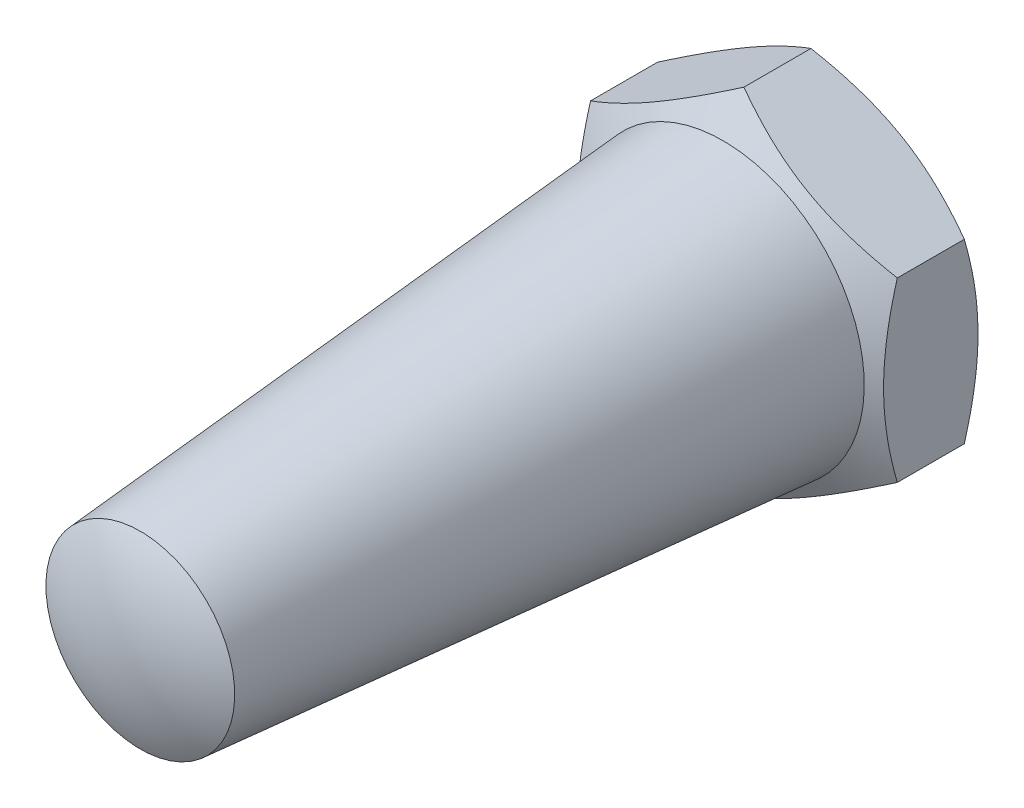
ISO-10303-21;
HEADER;
FILE_DESCRIPTION(('STEP AP214'),'2;1');
FILE_NAME('part.step','',(''),(''),'','','');
FILE_SCHEMA(('AUTOMOTIVE_DESIGN { 1 0 10303 214 1 1 1 1 }'));
ENDSEC;
DATA;
#1=APPLICATION_CONTEXT('core data for automotive mechanical design processes');
#2=APPLICATION_PROTOCOL_DEFINITION('international standard','automotive_design',2000,#1);
#3=PRODUCT_CONTEXT('',#1,'mechanical');
#4=PRODUCT('Part','Part','',(#3));
#5=PRODUCT_RELATED_PRODUCT_CATEGORY('part','',(#4));
#6=PRODUCT_DEFINITION_FORMATION('','',#4);
#7=PRODUCT_DEFINITION_CONTEXT('part definition',#1,'design');
#8=PRODUCT_DEFINITION('design','',#6,#7);
#9=PRODUCT_DEFINITION_SHAPE('','',#8);
#10=(LENGTH_UNIT() NAMED_UNIT(*) SI_UNIT(.MILLI.,.METRE.));
#11=(NAMED_UNIT(*) PLANE_ANGLE_UNIT() SI_UNIT($,.RADIAN.));
#12=(NAMED_UNIT(*) SI_UNIT($,.STERADIAN.) SOLID_ANGLE_UNIT());
#13=UNCERTAINTY_MEASURE_WITH_UNIT(LENGTH_MEASURE(1.E-05),#10,'distance_accuracy_value','');
#14=(GEOMETRIC_REPRESENTATION_CONTEXT(3) GLOBAL_UNCERTAINTY_ASSIGNED_CONTEXT((#13)) GLOBAL_UNIT_ASSIGNED_CONTEXT((#10,
#11,#12)) REPRESENTATION_CONTEXT('',''));
#15=CARTESIAN_POINT('',(0.,0.,0.));
#16=DIRECTION('',(0.,0.,1.));
#17=DIRECTION('',(1.,0.,0.));
#18=AXIS2_PLACEMENT_3D('',#15,#16,#17);
#19=CARTESIAN_POINT('',(0.,0.,0.));
#20=DIRECTION('',(0.,0.,1.));
#21=DIRECTION('',(-0.866025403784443,0.499999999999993,0.));
#22=AXIS2_PLACEMENT_3D('',#19,#20,#21);
#23=CONICAL_SURFACE('',#22,6.5,1.0471975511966);
#24=CARTESIAN_POINT('',(-6.5,-3.75300768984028,0.580623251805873));
#25=CARTESIAN_POINT('',(-6.5,-3.58802701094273,0.533004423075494));
#26=CARTESIAN_POINT('',(-6.5,-3.42243120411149,0.487546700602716));
#27=CARTESIAN_POINT('',(-6.5,-3.08989477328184,0.401548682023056));
#28=CARTESIAN_POINT('',(-6.5,-2.92295360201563,0.361010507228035));
#29=CARTESIAN_POINT('',(-6.5,-2.41945714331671,0.247571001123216));
#30=CARTESIAN_POINT('',(-6.5,-2.08091438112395,0.183047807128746));
#31=CARTESIAN_POINT('',(-6.5,-1.57429129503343,0.107386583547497));
#32=CARTESIAN_POINT('',(-6.5,-1.40772471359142,0.0858328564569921));
#33=CARTESIAN_POINT('',(-6.5,-1.0738389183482,0.0496903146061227));
#34=CARTESIAN_POINT('',(-6.5,-0.90651977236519,0.03510088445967));
#35=CARTESIAN_POINT('',(-6.5,-0.571590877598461,0.013258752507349));
#36=CARTESIAN_POINT('',(-6.5,-0.403981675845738,0.0059977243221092));
#37=CARTESIAN_POINT('',(-6.5,-0.0686176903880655,-0.00103969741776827));
#38=CARTESIAN_POINT('',(-6.5,0.0991370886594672,-0.00081632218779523));
#39=CARTESIAN_POINT('',(-6.5,0.558731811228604,0.0100834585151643));
#40=CARTESIAN_POINT('',(-6.5,0.850421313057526,0.0283818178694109));
#41=CARTESIAN_POINT('',(-6.5,1.43186293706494,0.0864063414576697));
#42=CARTESIAN_POINT('',(-6.5,1.72161301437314,0.126152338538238));
#43=CARTESIAN_POINT('',(-6.5,2.30422480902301,0.22550590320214));
#44=CARTESIAN_POINT('',(-6.5,2.59701301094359,0.285534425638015));
#45=CARTESIAN_POINT('',(-6.5,3.17822309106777,0.421774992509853));
#46=CARTESIAN_POINT('',(-6.5,3.46665241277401,0.497955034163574));
#47=CARTESIAN_POINT('',(-6.5,3.75300768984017,0.580623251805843));
#48=B_SPLINE_CURVE_WITH_KNOTS('',3,(#24,#25,#26,#27,#28,#29,#30,#31,#32,#33,#34,#35,#36,#37,#38,
#39,#40,#41,#42,#43,#44,#45,#46,#47),.UNSPECIFIED.,.F.,.F.,(4,2,2,2,2,2,2,2,2,2,2,4),(0.,
0.515105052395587,1.03043143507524,2.06322554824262,2.56697389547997,3.07067772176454,
3.57380860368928,4.0769239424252,4.9527935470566,5.82947446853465,6.72559912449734,
7.61996451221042),.UNSPECIFIED.);
#49=CARTESIAN_POINT('',(-6.5,0.,0.));
#50=VERTEX_POINT('',#49);
#51=CARTESIAN_POINT('',(-6.5,3.7527767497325,0.580556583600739));
#52=VERTEX_POINT('',#51);
#53=EDGE_CURVE('E144',#50,#52,#48,.T.);
#54=ORIENTED_EDGE('',*,*,#53,.T.);
#55=CARTESIAN_POINT('',(-6.5002,3.75266127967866,0.580623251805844));
#56=CARTESIAN_POINT('',(-6.35732254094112,3.83515161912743,0.533004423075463));
#57=CARTESIAN_POINT('',(-6.21391236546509,3.91794952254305,0.487546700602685));
#58=CARTESIAN_POINT('',(-5.92592736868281,4.08421773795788,0.401548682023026));
#59=CARTESIAN_POINT('',(-5.78135207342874,4.16768832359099,0.361010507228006));
#60=CARTESIAN_POINT('',(-5.34531134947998,4.41943655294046,0.247571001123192));
#61=CARTESIAN_POINT('',(-5.05212471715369,4.58870793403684,0.183047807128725));
#62=CARTESIAN_POINT('',(-4.61337625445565,4.8420194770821,0.107386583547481));
#63=CARTESIAN_POINT('',(-4.46912536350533,4.92530276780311,0.0858328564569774));
#64=CARTESIAN_POINT('',(-4.17997178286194,5.09224566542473,0.0496903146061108));
#65=CARTESIAN_POINT('',(-4.03506915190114,5.17590523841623,0.0351008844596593));
#66=CARTESIAN_POINT('',(-3.74501222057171,5.3433696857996,0.0132587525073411));
#67=CARTESIAN_POINT('',(-3.59985839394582,5.42717428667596,0.00599772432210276));
#68=CARTESIAN_POINT('',(-3.30942466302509,5.59485627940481,-0.00103969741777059));
#69=CARTESIAN_POINT('',(-3.16414476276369,5.67873366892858,-0.000816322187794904));
#70=CARTESIAN_POINT('',(-2.76612405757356,5.90853103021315,0.0100834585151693));
#71=CARTESIAN_POINT('',(-2.51351353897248,6.05437578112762,0.0283818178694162));
#72=CARTESIAN_POINT('',(-2.00997032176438,6.34509659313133,0.0864063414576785));
#73=CARTESIAN_POINT('',(-1.75903939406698,6.48997163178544,0.12615233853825));
#74=CARTESIAN_POINT('',(-1.25448277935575,6.78127752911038,0.225505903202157));
#75=CARTESIAN_POINT('',(-1.00092075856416,6.92767163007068,0.285534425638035));
#76=CARTESIAN_POINT('',(-0.497578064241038,7.21827667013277,0.421774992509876));
#77=CARTESIAN_POINT('',(-0.247790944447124,7.3624913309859,0.4979550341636));
#78=CARTESIAN_POINT('',(0.00019999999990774,7.50566896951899,0.580623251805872));
#79=B_SPLINE_CURVE_WITH_KNOTS('',3,(#55,#56,#57,#58,#59,#60,#61,#62,#63,#64,#65,#66,#67,#68,#69,
#70,#71,#72,#73,#74,#75,#76,#77,#78),.UNSPECIFIED.,.F.,.F.,(4,2,2,2,2,2,2,2,2,2,2,4),(0.,
0.515105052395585,1.03043143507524,2.06322554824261,2.56697389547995,3.07067772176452,
3.57380860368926,4.07692394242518,4.95279354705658,5.82947446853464,6.72559912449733,
7.61996451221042),.UNSPECIFIED.);
#80=CARTESIAN_POINT('',(-3.25000000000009,5.6291651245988,0.));
#81=VERTEX_POINT('',#80);
#82=EDGE_CURVE('E96',#52,#81,#79,.T.);
#83=ORIENTED_EDGE('',*,*,#82,.T.);
#84=CARTESIAN_POINT('',(0.,0.,0.));
#85=DIRECTION('',(0.,0.,-1.));
#86=DIRECTION('',(0.866025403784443,-0.499999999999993,0.));
#87=AXIS2_PLACEMENT_3D('',#84,#85,#86);
#88=CIRCLE('',#87,6.5);
#89=EDGE_CURVE('E271',#50,#81,#88,.T.);
#90=ORIENTED_EDGE('',*,*,#89,.F.);
#91=EDGE_LOOP('',(#54,#83,#90));
#92=FACE_BOUND('',#91,.T.);
#93=ADVANCED_FACE('F14',(#92),#23,.T.);
#94=CARTESIAN_POINT('',(3.24999999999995,5.62916512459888,0.));
#95=VERTEX_POINT('',#94);
#96=EDGE_CURVE('E272',#81,#95,#88,.T.);
#97=ORIENTED_EDGE('',*,*,#96,.F.);
#98=CARTESIAN_POINT('',(0.,7.50555349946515,0.580556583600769));
#99=VERTEX_POINT('',#98);
#100=EDGE_CURVE('E110',#81,#99,#79,.T.);
#101=ORIENTED_EDGE('',*,*,#100,.T.);
#102=CARTESIAN_POINT('',(-5.54115218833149,10.7047392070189,3.20652898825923));
#103=CARTESIAN_POINT('',(-5.29477516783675,10.5624933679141,3.06824212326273));
#104=CARTESIAN_POINT('',(-5.04783912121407,10.4199247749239,2.93126086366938));
#105=CARTESIAN_POINT('',(-4.55255194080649,10.1339705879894,2.66064242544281));
#106=CARTESIAN_POINT('',(-4.30420059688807,9.99058487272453,2.5270057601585));
#107=CARTESIAN_POINT('',(-3.80453528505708,9.70210297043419,2.26315208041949));
#108=CARTESIAN_POINT('',(-3.55321258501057,9.55700174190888,2.13295703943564));
#109=CARTESIAN_POINT('',(-3.04858964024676,9.26565754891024,1.8778010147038));
#110=CARTESIAN_POINT('',(-2.79528948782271,9.11941463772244,1.75283978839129));
#111=CARTESIAN_POINT('',(-2.27788742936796,8.82069241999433,1.50550497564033));
#112=CARTESIAN_POINT('',(-2.01370538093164,8.66816684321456,1.38335372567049));
#113=CARTESIAN_POINT('',(-1.48227292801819,8.36134417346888,1.14812603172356));
#114=CARTESIAN_POINT('',(-1.21502218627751,8.20704688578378,1.03505059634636));
#115=CARTESIAN_POINT('',(-0.677508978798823,7.89671349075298,0.820891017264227));
#116=CARTESIAN_POINT('',(-0.407253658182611,7.74068150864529,0.71978319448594));
#117=CARTESIAN_POINT('',(0.137136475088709,7.42637771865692,0.532757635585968));
#118=CARTESIAN_POINT('',(0.41127005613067,7.26810662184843,0.446835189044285));
#119=CARTESIAN_POINT('',(0.962017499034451,6.95013243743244,0.294716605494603));
#120=CARTESIAN_POINT('',(1.23860819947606,6.79044272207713,0.228410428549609));
#121=CARTESIAN_POINT('',(1.79533222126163,6.46901795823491,0.119232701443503));
#122=CARTESIAN_POINT('',(2.075465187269,6.30728311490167,0.0763588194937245));
#123=CARTESIAN_POINT('',(2.49534082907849,6.0648678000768,0.0324660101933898));
#124=CARTESIAN_POINT('',(2.63431772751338,5.98462945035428,0.0212465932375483));
#125=CARTESIAN_POINT('',(2.91256414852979,5.82398380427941,0.00560203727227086));
#126=CARTESIAN_POINT('',(3.05183366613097,5.74357651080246,0.0011767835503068));
#127=CARTESIAN_POINT('',(3.33040824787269,5.58274140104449,-0.000766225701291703));
#128=CARTESIAN_POINT('',(3.46971331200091,5.50231358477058,0.00171601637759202));
#129=CARTESIAN_POINT('',(3.74810781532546,5.34158244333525,0.0135243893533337));
#130=CARTESIAN_POINT('',(3.8871972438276,5.26127912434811,0.0228508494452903));
#131=CARTESIAN_POINT('',(4.21963736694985,5.06934472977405,0.0531229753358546));
#132=CARTESIAN_POINT('',(4.41277894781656,4.95783438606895,0.0771985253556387));
#133=CARTESIAN_POINT('',(4.79765951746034,4.73562348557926,0.137250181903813));
#134=CARTESIAN_POINT('',(4.98939831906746,4.62492303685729,0.17322784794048));
#135=CARTESIAN_POINT('',(5.56227463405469,4.29417274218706,0.297109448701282));
#136=CARTESIAN_POINT('',(5.94086491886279,4.07559353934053,0.40094059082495));
#137=CARTESIAN_POINT('',(6.50702481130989,3.74872097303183,0.581447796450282));
#138=CARTESIAN_POINT('',(6.6975208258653,3.63873804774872,0.646593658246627));
#139=CARTESIAN_POINT('',(7.07666370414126,3.41983980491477,0.783766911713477));
#140=CARTESIAN_POINT('',(7.26531055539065,3.31092449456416,0.855794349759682));
#141=CARTESIAN_POINT('',(7.64081231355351,3.09412845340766,1.00556559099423));
#142=CARTESIAN_POINT('',(7.82766776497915,2.98624740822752,1.08330759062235));
#143=CARTESIAN_POINT('',(8.19982403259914,2.77138288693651,1.24358180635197));
#144=CARTESIAN_POINT('',(8.38512486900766,2.66439939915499,1.32611396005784));
#145=CARTESIAN_POINT('',(8.82994392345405,2.4075829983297,1.52979204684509));
#146=CARTESIAN_POINT('',(9.08878329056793,2.25814202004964,1.65291133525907));
#147=CARTESIAN_POINT('',(9.60418751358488,1.96057325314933,1.90536084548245));
#148=CARTESIAN_POINT('',(9.86075221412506,1.81244555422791,2.03469148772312));
#149=CARTESIAN_POINT('',(10.3720363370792,1.51725552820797,2.29828873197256));
#150=CARTESIAN_POINT('',(10.6267553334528,1.37019344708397,2.43255643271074));
#151=CARTESIAN_POINT('',(11.1346169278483,1.07697941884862,2.70501702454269));
#152=CARTESIAN_POINT('',(11.387759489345,0.930827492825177,2.8432100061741));
#153=CARTESIAN_POINT('',(11.8930170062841,0.639116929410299,3.12292631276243));
#154=CARTESIAN_POINT('',(12.1451304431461,0.493559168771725,3.26445328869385));
#155=CARTESIAN_POINT('',(12.6482508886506,0.203082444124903,3.55010805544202));
#156=CARTESIAN_POINT('',(12.8992578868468,0.0581634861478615,3.69423587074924));
#157=CARTESIAN_POINT('',(13.6508155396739,-0.375748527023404,4.1297725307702));
#158=CARTESIAN_POINT('',(14.1499773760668,-0.663939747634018,4.42437620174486));
#159=CARTESIAN_POINT('',(15.1023905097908,-1.21381572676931,4.99368726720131));
#160=CARTESIAN_POINT('',(15.5558642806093,-1.4756289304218,5.26790069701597));
#161=CARTESIAN_POINT('',(16.4611277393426,-1.99828303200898,5.82005580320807));
#162=CARTESIAN_POINT('',(16.9129173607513,-2.25912389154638,6.09799762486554));
#163=CARTESIAN_POINT('',(17.813986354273,-2.77935631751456,6.65596618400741));
#164=CARTESIAN_POINT('',(18.2632692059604,-3.03874989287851,6.93598544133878));
#165=CARTESIAN_POINT('',(19.1607624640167,-3.55691786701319,7.49823452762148));
#166=CARTESIAN_POINT('',(19.6089729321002,-3.81569230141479,7.78046422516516));
#167=CARTESIAN_POINT('',(20.0567911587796,-4.0742402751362,8.06351575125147));
#168=B_SPLINE_CURVE_WITH_KNOTS('',3,(#102,#103,#104,#105,#106,#107,#108,#109,#110,#111,#112,
#113,#114,#115,#116,#117,#118,#119,#120,#121,#122,#123,#124,#125,#126,#127,#128,#129,#130,#131,
#132,#133,#134,#135,#136,#137,#138,#139,#140,#141,#142,#143,#144,#145,#146,#147,#148,#149,#150,
#151,#152,#153,#154,#155,#156,#157,#158,#159,#160,#161,#162,#163,#164,#165,#166,#167),
.UNSPECIFIED.,.F.,.F.,(4,2,2,2,2,2,2,2,2,2,2,2,2,2,2,2,2,2,2,2,2,2,2,2,2,2,2,2,2,2,2,2,4),(0.,
0.948973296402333,1.89809136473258,2.85225848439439,3.80638133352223,4.79206603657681,
5.77786012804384,6.76166991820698,7.74517399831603,8.72305155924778,9.70083179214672,
10.1833150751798,10.6657902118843,11.1482651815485,11.630763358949,12.3033341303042,
12.9759930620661,14.3220280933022,15.0101990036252,15.6983745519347,16.3863338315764,
17.0742841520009,18.0439299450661,19.0136414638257,19.9835701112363,20.9535211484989,
21.9245888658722,22.8956657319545,24.8375327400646,26.6107620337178,28.3840606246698,
30.1526583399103,31.9211517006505),.UNSPECIFIED.);
#169=EDGE_CURVE('E182',#99,#95,#168,.T.);
#170=ORIENTED_EDGE('',*,*,#169,.T.);
#171=EDGE_LOOP('',(#97,#101,#170));
#172=FACE_BOUND('',#171,.T.);
#173=ADVANCED_FACE('F139',(#172),#23,.T.);
#174=CARTESIAN_POINT('',(6.5,0.,0.));
#175=VERTEX_POINT('',#174);
#176=EDGE_CURVE('E107',#95,#175,#88,.T.);
#177=ORIENTED_EDGE('',*,*,#176,.F.);
#178=CARTESIAN_POINT('',(6.5,3.7527767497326,0.580556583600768));
#179=VERTEX_POINT('',#178);
#180=EDGE_CURVE('E175',#95,#179,#168,.T.);
#181=ORIENTED_EDGE('',*,*,#180,.T.);
#182=CARTESIAN_POINT('',(6.5,3.75300768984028,0.580623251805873));
#183=CARTESIAN_POINT('',(6.5,3.58802701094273,0.533004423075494));
#184=CARTESIAN_POINT('',(6.5,3.42243120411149,0.487546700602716));
#185=CARTESIAN_POINT('',(6.5,3.08989477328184,0.401548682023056));
#186=CARTESIAN_POINT('',(6.5,2.92295360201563,0.361010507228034));
#187=CARTESIAN_POINT('',(6.5,2.41945714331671,0.247571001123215));
#188=CARTESIAN_POINT('',(6.5,2.08091438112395,0.183047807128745));
#189=CARTESIAN_POINT('',(6.5,1.57429129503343,0.107386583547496));
#190=CARTESIAN_POINT('',(6.5,1.40772471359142,0.0858328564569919));
#191=CARTESIAN_POINT('',(6.5,1.0738389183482,0.0496903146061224));
#192=CARTESIAN_POINT('',(6.5,0.90651977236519,0.0351008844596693));
#193=CARTESIAN_POINT('',(6.5,0.571590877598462,0.0132587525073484));
#194=CARTESIAN_POINT('',(6.5,0.403981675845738,0.00599772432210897));
#195=CARTESIAN_POINT('',(6.5,0.0686176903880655,-0.00103969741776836));
#196=CARTESIAN_POINT('',(6.5,-0.0991370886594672,-0.000816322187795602));
#197=CARTESIAN_POINT('',(6.5,-0.558731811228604,0.0100834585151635));
#198=CARTESIAN_POINT('',(6.5,-0.850421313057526,0.0283818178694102));
#199=CARTESIAN_POINT('',(6.5,-1.43186293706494,0.0864063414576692));
#200=CARTESIAN_POINT('',(6.5,-1.72161301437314,0.126152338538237));
#201=CARTESIAN_POINT('',(6.5,-2.30422480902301,0.225505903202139));
#202=CARTESIAN_POINT('',(6.5,-2.59701301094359,0.285534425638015));
#203=CARTESIAN_POINT('',(6.5,-3.17822309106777,0.421774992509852));
#204=CARTESIAN_POINT('',(6.5,-3.46665241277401,0.497955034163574));
#205=CARTESIAN_POINT('',(6.5,-3.75300768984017,0.580623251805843));
#206=B_SPLINE_CURVE_WITH_KNOTS('',3,(#182,#183,#184,#185,#186,#187,#188,#189,#190,#191,#192,
#193,#194,#195,#196,#197,#198,#199,#200,#201,#202,#203,#204,#205),.UNSPECIFIED.,.F.,.F.,(4,2,2,
2,2,2,2,2,2,2,2,4),(0.,0.515105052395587,1.03043143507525,2.06322554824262,2.56697389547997,
3.07067772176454,3.57380860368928,4.0769239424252,4.9527935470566,5.82947446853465,
6.72559912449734,7.61996451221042),.UNSPECIFIED.);
#207=EDGE_CURVE('E219',#179,#175,#206,.T.);
#208=ORIENTED_EDGE('',*,*,#207,.T.);
#209=EDGE_LOOP('',(#177,#181,#208));
#210=FACE_BOUND('',#209,.T.);
#211=ADVANCED_FACE('F278',(#210),#23,.T.);
#212=CARTESIAN_POINT('',(3.2500000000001,-5.6291651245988,0.));
#213=VERTEX_POINT('',#212);
#214=EDGE_CURVE('E104',#175,#213,#88,.T.);
#215=ORIENTED_EDGE('',*,*,#214,.F.);
#216=CARTESIAN_POINT('',(6.5,-3.7527767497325,0.580556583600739));
#217=VERTEX_POINT('',#216);
#218=EDGE_CURVE('E167',#175,#217,#206,.T.);
#219=ORIENTED_EDGE('',*,*,#218,.T.);
#220=CARTESIAN_POINT('',(6.5002,-3.75266127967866,0.580623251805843));
#221=CARTESIAN_POINT('',(6.35732254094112,-3.83515161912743,0.533004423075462));
#222=CARTESIAN_POINT('',(6.21391236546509,-3.91794952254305,0.487546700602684));
#223=CARTESIAN_POINT('',(5.92592736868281,-4.08421773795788,0.401548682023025));
#224=CARTESIAN_POINT('',(5.78135207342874,-4.16768832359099,0.361010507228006));
#225=CARTESIAN_POINT('',(5.34531134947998,-4.41943655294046,0.247571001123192));
#226=CARTESIAN_POINT('',(5.0521247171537,-4.58870793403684,0.183047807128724));
#227=CARTESIAN_POINT('',(4.61337625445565,-4.8420194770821,0.10738658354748));
#228=CARTESIAN_POINT('',(4.46912536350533,-4.92530276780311,0.0858328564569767));
#229=CARTESIAN_POINT('',(4.17997178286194,-5.09224566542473,0.0496903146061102));
#230=CARTESIAN_POINT('',(4.03506915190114,-5.17590523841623,0.0351008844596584));
#231=CARTESIAN_POINT('',(3.74501222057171,-5.3433696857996,0.0132587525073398));
#232=CARTESIAN_POINT('',(3.59985839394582,-5.42717428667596,0.00599772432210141));
#233=CARTESIAN_POINT('',(3.30942466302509,-5.59485627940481,-0.00103969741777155));
#234=CARTESIAN_POINT('',(3.16414476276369,-5.67873366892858,-0.000816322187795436));
#235=CARTESIAN_POINT('',(2.76612405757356,-5.90853103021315,0.0100834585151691));
#236=CARTESIAN_POINT('',(2.51351353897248,-6.05437578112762,0.0283818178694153));
#237=CARTESIAN_POINT('',(2.00997032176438,-6.34509659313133,0.0864063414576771));
#238=CARTESIAN_POINT('',(1.75903939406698,-6.48997163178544,0.126152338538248));
#239=CARTESIAN_POINT('',(1.25448277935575,-6.78127752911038,0.225505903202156));
#240=CARTESIAN_POINT('',(1.00092075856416,-6.92767163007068,0.285534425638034));
#241=CARTESIAN_POINT('',(0.497578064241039,-7.21827667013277,0.421774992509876));
#242=CARTESIAN_POINT('',(0.247790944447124,-7.3624913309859,0.497955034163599));
#243=CARTESIAN_POINT('',(-0.00019999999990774,-7.50566896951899,0.580623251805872));
#244=B_SPLINE_CURVE_WITH_KNOTS('',3,(#220,#221,#222,#223,#224,#225,#226,#227,#228,#229,#230,
#231,#232,#233,#234,#235,#236,#237,#238,#239,#240,#241,#242,#243),.UNSPECIFIED.,.F.,.F.,(4,2,2,
2,2,2,2,2,2,2,2,4),(0.,0.515105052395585,1.03043143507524,2.06322554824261,2.56697389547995,
3.07067772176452,3.57380860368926,4.07692394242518,4.95279354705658,5.82947446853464,
6.72559912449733,7.61996451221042),.UNSPECIFIED.);
#245=EDGE_CURVE('E217',#217,#213,#244,.T.);
#246=ORIENTED_EDGE('',*,*,#245,.T.);
#247=EDGE_LOOP('',(#215,#219,#246));
#248=FACE_BOUND('',#247,.T.);
#249=ADVANCED_FACE('F280',(#248),#23,.T.);
#250=CARTESIAN_POINT('',(-3.24999999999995,-5.62916512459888,0.));
#251=VERTEX_POINT('',#250);
#252=EDGE_CURVE('E109',#213,#251,#88,.T.);
#253=ORIENTED_EDGE('',*,*,#252,.F.);
#254=CARTESIAN_POINT('',(0.,-7.50555349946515,0.580556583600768));
#255=VERTEX_POINT('',#254);
#256=EDGE_CURVE('E159',#213,#255,#244,.T.);
#257=ORIENTED_EDGE('',*,*,#256,.T.);
#258=CARTESIAN_POINT('',(-12.0411521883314,-0.553591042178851,3.20652898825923));
#259=CARTESIAN_POINT('',(-11.7947751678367,-0.695836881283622,3.06824212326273));
#260=CARTESIAN_POINT('',(-11.547839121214,-0.838405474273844,2.93126086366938));
#261=CARTESIAN_POINT('',(-11.0525519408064,-1.12435966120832,2.66064242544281));
#262=CARTESIAN_POINT('',(-10.804200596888,-1.26774537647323,2.5270057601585));
#263=CARTESIAN_POINT('',(-10.304535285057,-1.55622727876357,2.26315208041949));
#264=CARTESIAN_POINT('',(-10.0532125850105,-1.70132850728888,2.13295703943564));
#265=CARTESIAN_POINT('',(-9.54858964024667,-1.99267270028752,1.8778010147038));
#266=CARTESIAN_POINT('',(-9.29528948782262,-2.13891561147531,1.75283978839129));
#267=CARTESIAN_POINT('',(-8.77788742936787,-2.43763782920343,1.50550497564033));
#268=CARTESIAN_POINT('',(-8.51370538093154,-2.5901634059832,1.38335372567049));
#269=CARTESIAN_POINT('',(-7.9822729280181,-2.89698607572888,1.14812603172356));
#270=CARTESIAN_POINT('',(-7.71502218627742,-3.05128336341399,1.03505059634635));
#271=CARTESIAN_POINT('',(-7.17750897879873,-3.36161675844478,0.820891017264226));
#272=CARTESIAN_POINT('',(-6.90725365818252,-3.51764874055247,0.719783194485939));
#273=CARTESIAN_POINT('',(-6.3628635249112,-3.83195253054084,0.532757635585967));
#274=CARTESIAN_POINT('',(-6.08872994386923,-3.99022362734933,0.446835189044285));
#275=CARTESIAN_POINT('',(-5.53798250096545,-4.30819781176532,0.294716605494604));
#276=CARTESIAN_POINT('',(-5.26139180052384,-4.46788752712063,0.228410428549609));
#277=CARTESIAN_POINT('',(-4.70466777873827,-4.78931229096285,0.119232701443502));
#278=CARTESIAN_POINT('',(-4.42453481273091,-4.95104713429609,0.0763588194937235));
#279=CARTESIAN_POINT('',(-4.00465917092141,-5.19346244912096,0.0324660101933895));
#280=CARTESIAN_POINT('',(-3.86568227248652,-5.27370079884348,0.0212465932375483));
#281=CARTESIAN_POINT('',(-3.58743585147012,-5.43434644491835,0.00560203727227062));
#282=CARTESIAN_POINT('',(-3.44816633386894,-5.5147537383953,0.00117678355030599));
#283=CARTESIAN_POINT('',(-3.16959175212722,-5.67558884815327,-0.000766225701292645));
#284=CARTESIAN_POINT('',(-3.030286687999,-5.75601666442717,0.00171601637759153));
#285=CARTESIAN_POINT('',(-2.75189218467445,-5.91674780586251,0.0135243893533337));
#286=CARTESIAN_POINT('',(-2.61280275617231,-5.99705112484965,0.0228508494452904));
#287=CARTESIAN_POINT('',(-2.28036263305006,-6.18898551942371,0.0531229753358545));
#288=CARTESIAN_POINT('',(-2.08722105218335,-6.30049586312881,0.0771985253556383));
#289=CARTESIAN_POINT('',(-1.70234048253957,-6.5227067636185,0.137250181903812));
#290=CARTESIAN_POINT('',(-1.51060168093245,-6.63340721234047,0.17322784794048));
#291=CARTESIAN_POINT('',(-0.937725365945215,-6.9641575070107,0.297109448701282));
#292=CARTESIAN_POINT('',(-0.559135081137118,-7.18273670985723,0.400940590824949));
#293=CARTESIAN_POINT('',(0.0070248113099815,-7.50960927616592,0.581447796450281));
#294=CARTESIAN_POINT('',(0.197520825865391,-7.61959220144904,0.646593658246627));
#295=CARTESIAN_POINT('',(0.576663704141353,-7.83849044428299,0.783766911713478));
#296=CARTESIAN_POINT('',(0.765310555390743,-7.9474057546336,0.855794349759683));
#297=CARTESIAN_POINT('',(1.14081231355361,-8.1642017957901,1.00556559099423));
#298=CARTESIAN_POINT('',(1.32766776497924,-8.27208284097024,1.08330759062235));
#299=CARTESIAN_POINT('',(1.69982403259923,-8.48694736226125,1.24358180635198));
#300=CARTESIAN_POINT('',(1.88512486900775,-8.59393085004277,1.32611396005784));
#301=CARTESIAN_POINT('',(2.32994392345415,-8.85074725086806,1.52979204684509));
#302=CARTESIAN_POINT('',(2.58878329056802,-9.00018822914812,1.65291133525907));
#303=CARTESIAN_POINT('',(3.10418751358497,-9.29775699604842,1.90536084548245));
#304=CARTESIAN_POINT('',(3.36075221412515,-9.44588469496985,2.03469148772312));
#305=CARTESIAN_POINT('',(3.87203633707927,-9.74107472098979,2.29828873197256));
#306=CARTESIAN_POINT('',(4.12675533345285,-9.88813680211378,2.43255643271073));
#307=CARTESIAN_POINT('',(4.63461692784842,-10.1813508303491,2.70501702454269));
#308=CARTESIAN_POINT('',(4.88775948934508,-10.3275027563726,2.84321000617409));
#309=CARTESIAN_POINT('',(5.3930170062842,-10.6192133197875,3.12292631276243));
#310=CARTESIAN_POINT('',(5.64513044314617,-10.764771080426,3.26445328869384));
#311=CARTESIAN_POINT('',(6.14825088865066,-11.0552478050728,3.55010805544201));
#312=CARTESIAN_POINT('',(6.39925788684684,-11.2001667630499,3.69423587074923));
#313=CARTESIAN_POINT('',(7.15081553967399,-11.6340787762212,4.1297725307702));
#314=CARTESIAN_POINT('',(7.64997737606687,-11.9222699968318,4.42437620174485));
#315=CARTESIAN_POINT('',(8.6023905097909,-12.4721459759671,4.99368726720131));
#316=CARTESIAN_POINT('',(9.05586428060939,-12.7339591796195,5.26790069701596));
#317=CARTESIAN_POINT('',(9.96112773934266,-13.2566132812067,5.82005580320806));
#318=CARTESIAN_POINT('',(10.4129173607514,-13.5174541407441,6.09799762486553));
#319=CARTESIAN_POINT('',(11.3139863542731,-14.0376865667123,6.6559661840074));
#320=CARTESIAN_POINT('',(11.7632692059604,-14.2970801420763,6.93598544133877));
#321=CARTESIAN_POINT('',(12.6607624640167,-14.8152481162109,7.49823452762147));
#322=CARTESIAN_POINT('',(13.1089729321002,-15.0740225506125,7.78046422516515));
#323=CARTESIAN_POINT('',(13.5567911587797,-15.3325705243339,8.06351575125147));
#324=B_SPLINE_CURVE_WITH_KNOTS('',3,(#258,#259,#260,#261,#262,#263,#264,#265,#266,#267,#268,
#269,#270,#271,#272,#273,#274,#275,#276,#277,#278,#279,#280,#281,#282,#283,#284,#285,#286,#287,
#288,#289,#290,#291,#292,#293,#294,#295,#296,#297,#298,#299,#300,#301,#302,#303,#304,#305,#306,
#307,#308,#309,#310,#311,#312,#313,#314,#315,#316,#317,#318,#319,#320,#321,#322,#323),
.UNSPECIFIED.,.F.,.F.,(4,2,2,2,2,2,2,2,2,2,2,2,2,2,2,2,2,2,2,2,2,2,2,2,2,2,2,2,2,2,2,2,4),(0.,
0.948973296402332,1.89809136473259,2.85225848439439,3.80638133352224,4.79206603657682,
5.77786012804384,6.76166991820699,7.74517399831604,8.72305155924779,9.70083179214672,
10.1833150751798,10.6657902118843,11.1482651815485,11.630763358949,12.3033341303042,
12.9759930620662,14.3220280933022,15.0101990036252,15.6983745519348,16.3863338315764,
17.0742841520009,18.0439299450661,19.0136414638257,19.9835701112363,20.9535211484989,
21.9245888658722,22.8956657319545,24.8375327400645,26.6107620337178,28.3840606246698,
30.1526583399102,31.9211517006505),.UNSPECIFIED.);
#325=EDGE_CURVE('E228',#255,#251,#324,.F.);
#326=ORIENTED_EDGE('',*,*,#325,.T.);
#327=EDGE_LOOP('',(#253,#257,#326));
#328=FACE_BOUND('',#327,.T.);
#329=ADVANCED_FACE('F293',(#328),#23,.T.);
#330=EDGE_CURVE('E239',#251,#50,#88,.T.);
#331=ORIENTED_EDGE('',*,*,#330,.F.);
#332=CARTESIAN_POINT('',(-6.5,-3.7527767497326,0.580556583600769));
#333=VERTEX_POINT('',#332);
#334=EDGE_CURVE('E87',#251,#333,#324,.F.);
#335=ORIENTED_EDGE('',*,*,#334,.T.);
#336=EDGE_CURVE('E88',#333,#50,#48,.T.);
#337=ORIENTED_EDGE('',*,*,#336,.T.);
#338=EDGE_LOOP('',(#331,#335,#337));
#339=FACE_BOUND('',#338,.T.);
#340=ADVANCED_FACE('F135',(#339),#23,.T.);
#341=CARTESIAN_POINT('',(5.62916512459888,-3.24999999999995,0.));
#342=DIRECTION('',(0.,0.,-1.));
#343=DIRECTION('',(0.866025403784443,-0.499999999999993,0.));
#344=AXIS2_PLACEMENT_3D('',#341,#342,#343);
#345=PLANE('',#344);
#346=CARTESIAN_POINT('',(0.,0.,0.));
#347=DIRECTION('',(0.,0.,-1.));
#348=DIRECTION('',(-0.866025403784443,0.499999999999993,0.));
#349=AXIS2_PLACEMENT_3D('',#346,#347,#348);
#350=CIRCLE('',#349,4.);
#351=CARTESIAN_POINT('',(-3.46410161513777,1.99999999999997,0.));
#352=VERTEX_POINT('',#351);
#353=EDGE_CURVE('E256',#352,#352,#350,.T.);
#354=ORIENTED_EDGE('',*,*,#353,.F.);
#355=EDGE_LOOP('',(#354));
#356=FACE_BOUND('',#355,.T.);
#357=ORIENTED_EDGE('',*,*,#252,.T.);
#358=ORIENTED_EDGE('',*,*,#330,.T.);
#359=ORIENTED_EDGE('',*,*,#89,.T.);
#360=ORIENTED_EDGE('',*,*,#96,.T.);
#361=ORIENTED_EDGE('',*,*,#176,.T.);
#362=ORIENTED_EDGE('',*,*,#214,.T.);
#363=EDGE_LOOP('',(#357,#358,#359,#360,#361,#362));
#364=FACE_BOUND('',#363,.T.);
#365=ADVANCED_FACE('F130',(#356,#364),#345,.T.);
#366=CARTESIAN_POINT('',(0.,7.50555349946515,-30.));
#367=DIRECTION('',(-0.500000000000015,0.866025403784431,0.));
#368=DIRECTION('',(-0.866025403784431,-0.500000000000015,0.));
#369=AXIS2_PLACEMENT_3D('',#366,#367,#368);
#370=PLANE('',#369);
#371=DIRECTION('',(0.,0.,1.));
#372=VECTOR('',#371,1.);
#373=CARTESIAN_POINT('',(0.,7.50555349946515,-30.));
#374=LINE('',#373,#372);
#375=CARTESIAN_POINT('',(0.,7.50555349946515,3.41944341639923));
#376=VERTEX_POINT('',#375);
#377=EDGE_CURVE('E254',#99,#376,#374,.T.);
#378=ORIENTED_EDGE('',*,*,#377,.F.);
#379=ORIENTED_EDGE('',*,*,#100,.F.);
#380=ORIENTED_EDGE('',*,*,#82,.F.);
#381=DIRECTION('',(0.,0.,1.));
#382=VECTOR('',#381,1.);
#383=CARTESIAN_POINT('',(-6.5,3.7527767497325,-30.));
#384=LINE('',#383,#382);
#385=CARTESIAN_POINT('',(-6.5,3.7527767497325,3.41944341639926));
#386=VERTEX_POINT('',#385);
#387=EDGE_CURVE('E35',#52,#386,#384,.T.);
#388=ORIENTED_EDGE('',*,*,#387,.T.);
#389=CARTESIAN_POINT('',(0.00019999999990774,7.50566896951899,3.41937674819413));
#390=CARTESIAN_POINT('',(-0.142677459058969,7.42317863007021,3.46699557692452));
#391=CARTESIAN_POINT('',(-0.286087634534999,7.34038072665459,3.5124532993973));
#392=CARTESIAN_POINT('',(-0.574072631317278,7.17411251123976,3.59845131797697));
#393=CARTESIAN_POINT('',(-0.718647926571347,7.09064192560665,3.63898949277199));
#394=CARTESIAN_POINT('',(-1.15468865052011,6.83889369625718,3.7524289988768));
#395=CARTESIAN_POINT('',(-1.4478752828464,6.6696223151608,3.81695219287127));
#396=CARTESIAN_POINT('',(-1.88662374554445,6.41631077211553,3.89261341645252));
#397=CARTESIAN_POINT('',(-2.03087463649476,6.33302748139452,3.91416714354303));
#398=CARTESIAN_POINT('',(-2.32002821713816,6.16608458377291,3.9503096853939));
#399=CARTESIAN_POINT('',(-2.46493084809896,6.0824250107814,3.96489911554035));
#400=CARTESIAN_POINT('',(-2.75498777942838,5.91496056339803,3.98674124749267));
#401=CARTESIAN_POINT('',(-2.90014160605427,5.83115596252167,3.99400227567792));
#402=CARTESIAN_POINT('',(-3.19057533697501,5.66347396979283,4.00103969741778));
#403=CARTESIAN_POINT('',(-3.33585523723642,5.57959658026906,4.0008163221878));
#404=CARTESIAN_POINT('',(-3.73387594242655,5.34979921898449,3.98991654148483));
#405=CARTESIAN_POINT('',(-3.98648646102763,5.20395446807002,3.9716181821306));
#406=CARTESIAN_POINT('',(-4.49002967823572,4.9132336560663,3.91359365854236));
#407=CARTESIAN_POINT('',(-4.74096060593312,4.7683586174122,3.87384766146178));
#408=CARTESIAN_POINT('',(-5.24551722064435,4.47705272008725,3.77449409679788));
#409=CARTESIAN_POINT('',(-5.49907924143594,4.33065861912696,3.71446557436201));
#410=CARTESIAN_POINT('',(-6.00242193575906,4.04005357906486,3.57822500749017));
#411=CARTESIAN_POINT('',(-6.25220905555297,3.89583891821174,3.50204496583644));
#412=CARTESIAN_POINT('',(-6.5002,3.75266127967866,3.41937674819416));
#413=B_SPLINE_CURVE_WITH_KNOTS('',3,(#389,#390,#391,#392,#393,#394,#395,#396,#397,#398,#399,
#400,#401,#402,#403,#404,#405,#406,#407,#408,#409,#410,#411,#412),.UNSPECIFIED.,.F.,.F.,(4,2,2,
2,2,2,2,2,2,2,2,4),(0.,0.51510505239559,1.03043143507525,2.06322554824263,2.56697389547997,
3.07067772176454,3.57380860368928,4.07692394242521,4.9527935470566,5.82947446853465,
6.72559912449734,7.61996451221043),.UNSPECIFIED.);
#414=EDGE_CURVE('E93',#376,#386,#413,.T.);
#415=ORIENTED_EDGE('',*,*,#414,.F.);
#416=EDGE_LOOP('',(#378,#379,#380,#388,#415));
#417=FACE_BOUND('',#416,.T.);
#418=ADVANCED_FACE('F92',(#417),#370,.T.);
#419=CARTESIAN_POINT('',(6.5,3.7527767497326,-30.));
#420=DIRECTION('',(0.499999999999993,0.866025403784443,0.));
#421=DIRECTION('',(-0.866025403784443,0.499999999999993,0.));
#422=AXIS2_PLACEMENT_3D('',#419,#420,#421);
#423=PLANE('',#422);
#424=DIRECTION('',(0.,0.,1.));
#425=VECTOR('',#424,1.);
#426=CARTESIAN_POINT('',(6.5,3.7527767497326,-30.));
#427=LINE('',#426,#425);
#428=CARTESIAN_POINT('',(6.5,3.7527767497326,3.41944341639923));
#429=VERTEX_POINT('',#428);
#430=EDGE_CURVE('E251',#179,#429,#427,.T.);
#431=ORIENTED_EDGE('',*,*,#430,.F.);
#432=ORIENTED_EDGE('',*,*,#180,.F.);
#433=ORIENTED_EDGE('',*,*,#169,.F.);
#434=ORIENTED_EDGE('',*,*,#377,.T.);
#435=CARTESIAN_POINT('',(-5.50464676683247,10.6836627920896,0.813953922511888));
#436=CARTESIAN_POINT('',(-5.25856626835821,10.5415881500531,0.951906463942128));
#437=CARTESIAN_POINT('',(-5.01192350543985,10.3991888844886,1.08854446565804));
#438=CARTESIAN_POINT('',(-4.517214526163,10.1135685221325,1.35845260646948));
#439=CARTESIAN_POINT('',(-4.26914809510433,9.97034730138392,1.49172222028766));
#440=CARTESIAN_POINT('',(-3.77002670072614,9.68217942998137,1.75481910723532));
#441=CARTESIAN_POINT('',(-3.5189628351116,9.53722763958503,1.88462393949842));
#442=CARTESIAN_POINT('',(-3.01484675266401,9.2461760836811,2.13895929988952));
#443=CARTESIAN_POINT('',(-2.76179462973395,9.10007637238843,2.26349007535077));
#444=CARTESIAN_POINT('',(-2.24505569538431,8.80173700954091,2.50981565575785));
#445=CARTESIAN_POINT('',(-1.98129000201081,8.64945181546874,2.63139101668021));
#446=CARTESIAN_POINT('',(-1.45068168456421,8.34310496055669,2.86540938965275));
#447=CARTESIAN_POINT('',(-1.18383872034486,8.18904310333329,2.97785138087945));
#448=CARTESIAN_POINT('',(-0.647143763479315,7.87918212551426,3.19067263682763));
#449=CARTESIAN_POINT('',(-0.377299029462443,7.72338719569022,3.29107606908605));
#450=CARTESIAN_POINT('',(0.166264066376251,7.40956089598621,3.4766162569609));
#451=CARTESIAN_POINT('',(0.439981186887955,7.25153024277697,3.56175779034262));
#452=CARTESIAN_POINT('',(0.989916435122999,6.93402497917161,3.71225918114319));
#453=CARTESIAN_POINT('',(1.2661121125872,6.77456333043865,3.77772667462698));
#454=CARTESIAN_POINT('',(1.82200305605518,6.45361954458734,3.88518106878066));
#455=CARTESIAN_POINT('',(2.10169797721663,6.29213760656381,3.92717026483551));
#456=CARTESIAN_POINT('',(2.52089047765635,6.05011670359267,3.96975845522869));
#457=CARTESIAN_POINT('',(2.65964585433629,5.970006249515,3.98054959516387));
#458=CARTESIAN_POINT('',(2.9374336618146,5.8096253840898,3.99535095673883));
#459=CARTESIAN_POINT('',(3.07646608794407,5.72935497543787,3.99936129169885));
#460=CARTESIAN_POINT('',(3.35455197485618,5.56880201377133,4.00049782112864));
#461=CARTESIAN_POINT('',(3.4936054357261,5.48851946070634,3.99762398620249));
#462=CARTESIAN_POINT('',(3.77148360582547,5.32808642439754,3.98506477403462));
#463=CARTESIAN_POINT('',(3.91030830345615,5.24793594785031,3.97537906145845));
#464=CARTESIAN_POINT('',(4.24317824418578,5.05575339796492,3.94419318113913));
#465=CARTESIAN_POINT('',(4.43700457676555,4.94384771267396,3.91951007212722));
#466=CARTESIAN_POINT('',(4.8232260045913,4.72086266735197,3.85820420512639));
#467=CARTESIAN_POINT('',(5.01562090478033,4.60978341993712,3.8215798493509));
#468=CARTESIAN_POINT('',(5.59043287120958,4.27791557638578,3.69573612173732));
#469=CARTESIAN_POINT('',(5.97026630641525,4.05861864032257,3.59056847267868));
#470=CARTESIAN_POINT('',(6.53828857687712,3.73067082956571,3.40807580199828));
#471=CARTESIAN_POINT('',(6.72942027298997,3.62032089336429,3.34226066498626));
#472=CARTESIAN_POINT('',(7.10982731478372,3.40069278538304,3.20376518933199));
#473=CARTESIAN_POINT('',(7.29910264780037,3.29141462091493,3.13108480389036));
#474=CARTESIAN_POINT('',(7.67585644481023,3.07389571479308,2.98002751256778));
#475=CARTESIAN_POINT('',(7.86333546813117,2.96565465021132,2.90165244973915));
#476=CARTESIAN_POINT('',(8.23673796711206,2.75007061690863,2.74013098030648));
#477=CARTESIAN_POINT('',(8.42266146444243,2.64272763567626,2.65698464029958));
#478=CARTESIAN_POINT('',(8.87505986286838,2.38153529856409,2.44905554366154));
#479=CARTESIAN_POINT('',(9.14079224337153,2.2281146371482,2.32212222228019));
#480=CARTESIAN_POINT('',(9.6698907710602,1.92263945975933,2.0618223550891));
#481=CARTESIAN_POINT('',(9.93325674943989,1.77058504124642,1.9284553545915));
#482=CARTESIAN_POINT('',(10.4580868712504,1.4675742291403,1.65663156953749));
#483=CARTESIAN_POINT('',(10.7195505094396,1.31661812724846,1.51817348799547));
#484=CARTESIAN_POINT('',(11.2408413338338,1.01565072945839,1.237238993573));
#485=CARTESIAN_POINT('',(11.5006685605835,0.865639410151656,1.09476268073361));
#486=CARTESIAN_POINT('',(12.019282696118,0.566217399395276,0.806400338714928));
#487=CARTESIAN_POINT('',(12.278067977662,0.41680764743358,0.660510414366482));
#488=CARTESIAN_POINT('',(12.7945079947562,0.118640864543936,0.366083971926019));
#489=CARTESIAN_POINT('',(13.0521627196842,-0.0301161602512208,0.217547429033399));
#490=CARTESIAN_POINT('',(13.82363380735,-0.475525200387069,-0.231257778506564));
#491=CARTESIAN_POINT('',(14.3360362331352,-0.771360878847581,-0.534766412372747));
#492=CARTESIAN_POINT('',(15.3127558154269,-1.33527019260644,-1.12056744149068));
#493=CARTESIAN_POINT('',(15.7773029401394,-1.60347660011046,-1.40235093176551));
#494=CARTESIAN_POINT('',(16.7047068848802,-2.13891351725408,-1.9696523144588));
#495=CARTESIAN_POINT('',(17.1675636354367,-2.40614398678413,-2.25517035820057));
#496=CARTESIAN_POINT('',(18.0907213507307,-2.9391293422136,-2.82825869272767));
#497=CARTESIAN_POINT('',(18.5510258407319,-3.20488626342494,-3.11582142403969));
#498=CARTESIAN_POINT('',(19.470562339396,-3.73578090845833,-3.69314970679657));
#499=CARTESIAN_POINT('',(19.9297944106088,-4.00091866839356,-3.98291512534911));
#500=CARTESIAN_POINT('',(20.3886360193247,-4.26583099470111,-4.27349716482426));
#501=B_SPLINE_CURVE_WITH_KNOTS('',3,(#435,#436,#437,#438,#439,#440,#441,#442,#443,#444,#445,
#446,#447,#448,#449,#450,#451,#452,#453,#454,#455,#456,#457,#458,#459,#460,#461,#462,#463,#464,
#465,#466,#467,#468,#469,#470,#471,#472,#473,#474,#475,#476,#477,#478,#479,#480,#481,#482,#483,
#484,#485,#486,#487,#488,#489,#490,#491,#492,#493,#494,#495,#496,#497,#498,#499,#500),
.UNSPECIFIED.,.F.,.F.,(4,2,2,2,2,2,2,2,2,2,2,2,2,2,2,2,2,2,2,2,2,2,2,2,2,2,2,2,2,2,2,2,4),(0.,
0.947611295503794,1.89536946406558,2.8482389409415,3.8010636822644,4.78476621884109,
5.76857855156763,6.75038157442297,7.73187670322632,8.70790002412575,9.68382790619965,
10.165457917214,10.6470798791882,11.128703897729,11.6103516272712,12.285475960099,
12.9606906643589,14.3118504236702,15.0027050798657,15.6935644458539,16.3842012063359,
17.074828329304,18.0709060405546,19.0670542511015,20.0634580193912,21.0598370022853,
22.0574144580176,23.0550012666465,25.0498701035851,26.8676185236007,28.6854408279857,
30.4983869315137,32.3112245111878),.UNSPECIFIED.);
#502=EDGE_CURVE('E103',#429,#376,#501,.F.);
#503=ORIENTED_EDGE('',*,*,#502,.F.);
#504=EDGE_LOOP('',(#431,#432,#433,#434,#503));
#505=FACE_BOUND('',#504,.T.);
#506=ADVANCED_FACE('F129',(#505),#423,.T.);
#507=CARTESIAN_POINT('',(6.5,-3.7527767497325,-30.));
#508=DIRECTION('',(1.,0.,0.));
#509=DIRECTION('',(0.,1.,0.));
#510=AXIS2_PLACEMENT_3D('',#507,#508,#509);
#511=PLANE('',#510);
#512=DIRECTION('',(0.,0.,1.));
#513=VECTOR('',#512,1.);
#514=CARTESIAN_POINT('',(6.5,-3.7527767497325,-30.));
#515=LINE('',#514,#513);
#516=CARTESIAN_POINT('',(6.5,-3.7527767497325,3.41944341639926));
#517=VERTEX_POINT('',#516);
#518=EDGE_CURVE('E246',#217,#517,#515,.T.);
#519=ORIENTED_EDGE('',*,*,#518,.F.);
#520=ORIENTED_EDGE('',*,*,#218,.F.);
#521=ORIENTED_EDGE('',*,*,#207,.F.);
#522=ORIENTED_EDGE('',*,*,#430,.T.);
#523=CARTESIAN_POINT('',(6.5,-3.75300768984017,3.41937674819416));
#524=CARTESIAN_POINT('',(6.5,-3.58802701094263,3.46699557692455));
#525=CARTESIAN_POINT('',(6.5,-3.42243120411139,3.51245329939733));
#526=CARTESIAN_POINT('',(6.5,-3.08989477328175,3.59845131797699));
#527=CARTESIAN_POINT('',(6.5,-2.92295360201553,3.63898949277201));
#528=CARTESIAN_POINT('',(6.5,-2.41945714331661,3.75242899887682));
#529=CARTESIAN_POINT('',(6.5,-2.08091438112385,3.81695219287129));
#530=CARTESIAN_POINT('',(6.5,-1.57429129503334,3.89261341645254));
#531=CARTESIAN_POINT('',(6.5,-1.40772471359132,3.91416714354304));
#532=CARTESIAN_POINT('',(6.5,-1.0738389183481,3.95030968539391));
#533=CARTESIAN_POINT('',(6.5,-0.906519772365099,3.96489911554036));
#534=CARTESIAN_POINT('',(6.5,-0.571590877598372,3.98674124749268));
#535=CARTESIAN_POINT('',(6.5,-0.403981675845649,3.99400227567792));
#536=CARTESIAN_POINT('',(6.5,-0.0686176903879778,4.00103969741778));
#537=CARTESIAN_POINT('',(6.5,0.0991370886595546,4.0008163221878));
#538=CARTESIAN_POINT('',(6.5,0.558731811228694,3.98991654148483));
#539=CARTESIAN_POINT('',(6.5,0.850421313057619,3.97161818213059));
#540=CARTESIAN_POINT('',(6.5,1.43186293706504,3.91359365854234));
#541=CARTESIAN_POINT('',(6.5,1.72161301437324,3.87384766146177));
#542=CARTESIAN_POINT('',(6.5,2.30422480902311,3.77449409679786));
#543=CARTESIAN_POINT('',(6.5,2.59701301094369,3.71446557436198));
#544=CARTESIAN_POINT('',(6.5,3.17822309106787,3.57822500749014));
#545=CARTESIAN_POINT('',(6.5,3.46665241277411,3.50204496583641));
#546=CARTESIAN_POINT('',(6.5,3.75300768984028,3.41937674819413));
#547=B_SPLINE_CURVE_WITH_KNOTS('',3,(#523,#524,#525,#526,#527,#528,#529,#530,#531,#532,#533,
#534,#535,#536,#537,#538,#539,#540,#541,#542,#543,#544,#545,#546),.UNSPECIFIED.,.F.,.F.,(4,2,2,
2,2,2,2,2,2,2,2,4),(0.,0.515105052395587,1.03043143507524,2.06322554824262,2.56697389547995,
3.07067772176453,3.57380860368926,4.07692394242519,4.95279354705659,5.82947446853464,
6.72559912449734,7.61996451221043),.UNSPECIFIED.);
#548=EDGE_CURVE('E183',#517,#429,#547,.T.);
#549=ORIENTED_EDGE('',*,*,#548,.F.);
#550=EDGE_LOOP('',(#519,#520,#521,#522,#549));
#551=FACE_BOUND('',#550,.T.);
#552=ADVANCED_FACE('F195',(#551),#511,.T.);
#553=CARTESIAN_POINT('',(0.,-7.50555349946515,-30.));
#554=DIRECTION('',(0.500000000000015,-0.866025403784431,0.));
#555=DIRECTION('',(0.866025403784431,0.500000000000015,0.));
#556=AXIS2_PLACEMENT_3D('',#553,#554,#555);
#557=PLANE('',#556);
#558=DIRECTION('',(0.,0.,1.));
#559=VECTOR('',#558,1.);
#560=CARTESIAN_POINT('',(0.,-7.50555349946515,-30.));
#561=LINE('',#560,#559);
#562=CARTESIAN_POINT('',(0.,-7.50555349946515,3.41944341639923));
#563=VERTEX_POINT('',#562);
#564=EDGE_CURVE('E244',#255,#563,#561,.T.);
#565=ORIENTED_EDGE('',*,*,#564,.F.);
#566=ORIENTED_EDGE('',*,*,#256,.F.);
#567=ORIENTED_EDGE('',*,*,#245,.F.);
#568=ORIENTED_EDGE('',*,*,#518,.T.);
#569=CARTESIAN_POINT('',(-0.00019999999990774,-7.50566896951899,3.41937674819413));
#570=CARTESIAN_POINT('',(0.142677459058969,-7.42317863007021,3.46699557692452));
#571=CARTESIAN_POINT('',(0.286087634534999,-7.34038072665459,3.5124532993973));
#572=CARTESIAN_POINT('',(0.574072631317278,-7.17411251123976,3.59845131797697));
#573=CARTESIAN_POINT('',(0.718647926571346,-7.09064192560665,3.63898949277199));
#574=CARTESIAN_POINT('',(1.15468865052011,-6.83889369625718,3.7524289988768));
#575=CARTESIAN_POINT('',(1.4478752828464,-6.6696223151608,3.81695219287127));
#576=CARTESIAN_POINT('',(1.88662374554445,-6.41631077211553,3.89261341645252));
#577=CARTESIAN_POINT('',(2.03087463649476,-6.33302748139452,3.91416714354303));
#578=CARTESIAN_POINT('',(2.32002821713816,-6.16608458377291,3.9503096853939));
#579=CARTESIAN_POINT('',(2.46493084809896,-6.0824250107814,3.96489911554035));
#580=CARTESIAN_POINT('',(2.75498777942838,-5.91496056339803,3.98674124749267));
#581=CARTESIAN_POINT('',(2.90014160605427,-5.83115596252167,3.99400227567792));
#582=CARTESIAN_POINT('',(3.19057533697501,-5.66347396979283,4.00103969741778));
#583=CARTESIAN_POINT('',(3.33585523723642,-5.57959658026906,4.0008163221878));
#584=CARTESIAN_POINT('',(3.73387594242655,-5.34979921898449,3.98991654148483));
#585=CARTESIAN_POINT('',(3.98648646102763,-5.20395446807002,3.9716181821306));
#586=CARTESIAN_POINT('',(4.49002967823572,-4.9132336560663,3.91359365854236));
#587=CARTESIAN_POINT('',(4.74096060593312,-4.7683586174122,3.87384766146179));
#588=CARTESIAN_POINT('',(5.24551722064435,-4.47705272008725,3.77449409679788));
#589=CARTESIAN_POINT('',(5.49907924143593,-4.33065861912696,3.71446557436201));
#590=CARTESIAN_POINT('',(6.00242193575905,-4.04005357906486,3.57822500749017));
#591=CARTESIAN_POINT('',(6.25220905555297,-3.89583891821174,3.50204496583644));
#592=CARTESIAN_POINT('',(6.5002,-3.75266127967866,3.41937674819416));
#593=B_SPLINE_CURVE_WITH_KNOTS('',3,(#569,#570,#571,#572,#573,#574,#575,#576,#577,#578,#579,
#580,#581,#582,#583,#584,#585,#586,#587,#588,#589,#590,#591,#592),.UNSPECIFIED.,.F.,.F.,(4,2,2,
2,2,2,2,2,2,2,2,4),(0.,0.515105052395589,1.03043143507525,2.06322554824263,2.56697389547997,
3.07067772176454,3.57380860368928,4.07692394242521,4.9527935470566,5.82947446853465,
6.72559912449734,7.61996451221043),.UNSPECIFIED.);
#594=EDGE_CURVE('E211',#563,#517,#593,.T.);
#595=ORIENTED_EDGE('',*,*,#594,.F.);
#596=EDGE_LOOP('',(#565,#566,#567,#568,#595));
#597=FACE_BOUND('',#596,.T.);
#598=ADVANCED_FACE('F202',(#597),#557,.T.);
#599=CARTESIAN_POINT('',(-6.5,-3.7527767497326,-30.));
#600=DIRECTION('',(-0.499999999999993,-0.866025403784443,0.));
#601=DIRECTION('',(0.866025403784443,-0.499999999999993,0.));
#602=AXIS2_PLACEMENT_3D('',#599,#600,#601);
#603=PLANE('',#602);
#604=DIRECTION('',(0.,0.,1.));
#605=VECTOR('',#604,1.);
#606=CARTESIAN_POINT('',(-6.5,-3.7527767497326,-30.));
#607=LINE('',#606,#605);
#608=CARTESIAN_POINT('',(-6.5,-3.7527767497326,3.41944341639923));
#609=VERTEX_POINT('',#608);
#610=EDGE_CURVE('E29',#333,#609,#607,.T.);
#611=ORIENTED_EDGE('',*,*,#610,.F.);
#612=ORIENTED_EDGE('',*,*,#334,.F.);
#613=ORIENTED_EDGE('',*,*,#325,.F.);
#614=ORIENTED_EDGE('',*,*,#564,.T.);
#615=CARTESIAN_POINT('',(-12.0046467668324,-0.57466745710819,0.813953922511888));
#616=CARTESIAN_POINT('',(-11.7585662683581,-0.71674209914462,0.951906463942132));
#617=CARTESIAN_POINT('',(-11.5119235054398,-0.859141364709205,1.08854446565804));
#618=CARTESIAN_POINT('',(-11.0172145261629,-1.14476172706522,1.35845260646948));
#619=CARTESIAN_POINT('',(-10.7691480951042,-1.28798294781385,1.49172222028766));
#620=CARTESIAN_POINT('',(-10.270026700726,-1.57615081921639,1.75481910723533));
#621=CARTESIAN_POINT('',(-10.0189628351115,-1.72110260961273,1.88462393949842));
#622=CARTESIAN_POINT('',(-9.51484675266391,-2.01215416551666,2.13895929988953));
#623=CARTESIAN_POINT('',(-9.26179462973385,-2.15825387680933,2.26349007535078));
#624=CARTESIAN_POINT('',(-8.74505569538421,-2.45659323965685,2.50981565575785));
#625=CARTESIAN_POINT('',(-8.48129000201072,-2.60887843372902,2.63139101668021));
#626=CARTESIAN_POINT('',(-7.95068168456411,-2.91522528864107,2.86540938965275));
#627=CARTESIAN_POINT('',(-7.68383872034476,-3.06928714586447,2.97785138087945));
#628=CARTESIAN_POINT('',(-7.14714376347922,-3.3791481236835,3.19067263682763));
#629=CARTESIAN_POINT('',(-6.87729902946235,-3.53494305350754,3.29107606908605));
#630=CARTESIAN_POINT('',(-6.33373593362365,-3.84876935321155,3.4766162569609));
#631=CARTESIAN_POINT('',(-6.06001881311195,-4.00680000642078,3.56175779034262));
#632=CARTESIAN_POINT('',(-5.5100835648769,-4.32430527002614,3.71225918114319));
#633=CARTESIAN_POINT('',(-5.23388788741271,-4.48376691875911,3.77772667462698));
#634=CARTESIAN_POINT('',(-4.67799694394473,-4.80471070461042,3.88518106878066));
#635=CARTESIAN_POINT('',(-4.39830202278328,-4.96619264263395,3.92717026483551));
#636=CARTESIAN_POINT('',(-3.97910952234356,-5.20821354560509,3.96975845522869));
#637=CARTESIAN_POINT('',(-3.84035414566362,-5.28832399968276,3.98054959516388));
#638=CARTESIAN_POINT('',(-3.56256633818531,-5.44870486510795,3.99535095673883));
#639=CARTESIAN_POINT('',(-3.42353391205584,-5.52897527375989,3.99936129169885));
#640=CARTESIAN_POINT('',(-3.14544802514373,-5.68952823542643,4.00049782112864));
#641=CARTESIAN_POINT('',(-3.00639456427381,-5.76981078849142,3.99762398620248));
#642=CARTESIAN_POINT('',(-2.72851639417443,-5.93024382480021,3.98506477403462));
#643=CARTESIAN_POINT('',(-2.58969169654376,-6.01039430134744,3.97537906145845));
#644=CARTESIAN_POINT('',(-2.25682175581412,-6.20257685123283,3.94419318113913));
#645=CARTESIAN_POINT('',(-2.06299542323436,-6.3144825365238,3.91951007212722));
#646=CARTESIAN_POINT('',(-1.67677399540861,-6.53746758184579,3.85820420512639));
#647=CARTESIAN_POINT('',(-1.48437909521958,-6.64854682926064,3.8215798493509));
#648=CARTESIAN_POINT('',(-0.909567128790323,-6.98041467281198,3.69573612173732));
#649=CARTESIAN_POINT('',(-0.529733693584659,-7.19971160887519,3.59056847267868));
#650=CARTESIAN_POINT('',(0.0382885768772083,-7.52765941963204,3.40807580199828));
#651=CARTESIAN_POINT('',(0.229420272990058,-7.63800935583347,3.34226066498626));
#652=CARTESIAN_POINT('',(0.609827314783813,-7.85763746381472,3.20376518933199));
#653=CARTESIAN_POINT('',(0.799102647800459,-7.96691562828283,3.13108480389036));
#654=CARTESIAN_POINT('',(1.17585644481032,-8.18443453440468,2.98002751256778));
#655=CARTESIAN_POINT('',(1.36333546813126,-8.29267559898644,2.90165244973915));
#656=CARTESIAN_POINT('',(1.73673796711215,-8.50825963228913,2.74013098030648));
#657=CARTESIAN_POINT('',(1.92266146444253,-8.61560261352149,2.65698464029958));
#658=CARTESIAN_POINT('',(2.37505986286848,-8.87679495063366,2.44905554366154));
#659=CARTESIAN_POINT('',(2.64079224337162,-9.03021561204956,2.32212222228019));
#660=CARTESIAN_POINT('',(3.16989077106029,-9.33569078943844,2.0618223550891));
#661=CARTESIAN_POINT('',(3.43325674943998,-9.48774520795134,1.9284553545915));
#662=CARTESIAN_POINT('',(3.9580868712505,-9.79075602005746,1.65663156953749));
#663=CARTESIAN_POINT('',(4.21955050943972,-9.9417121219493,1.51817348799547));
#664=CARTESIAN_POINT('',(4.74084133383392,-10.2426795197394,1.237238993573));
#665=CARTESIAN_POINT('',(5.00066856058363,-10.3926908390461,1.09476268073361));
#666=CARTESIAN_POINT('',(5.51928269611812,-10.6921128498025,0.806400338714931));
#667=CARTESIAN_POINT('',(5.77806797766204,-10.8415226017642,0.660510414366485));
#668=CARTESIAN_POINT('',(6.29450799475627,-11.1396893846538,0.366083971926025));
#669=CARTESIAN_POINT('',(6.55216271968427,-11.288446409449,0.217547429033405));
#670=CARTESIAN_POINT('',(7.32363380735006,-11.7338554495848,-0.231257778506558));
#671=CARTESIAN_POINT('',(7.83603623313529,-12.0296911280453,-0.534766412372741));
#672=CARTESIAN_POINT('',(8.81275581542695,-12.5936004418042,-1.12056744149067));
#673=CARTESIAN_POINT('',(9.27730294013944,-12.8618068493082,-1.40235093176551));
#674=CARTESIAN_POINT('',(10.2047068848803,-13.3972437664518,-1.96965231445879));
#675=CARTESIAN_POINT('',(10.6675636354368,-13.6644742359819,-2.25517035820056));
#676=CARTESIAN_POINT('',(11.5907213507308,-14.1974595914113,-2.82825869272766));
#677=CARTESIAN_POINT('',(12.0510258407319,-14.4632165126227,-3.11582142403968));
#678=CARTESIAN_POINT('',(12.970562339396,-14.9941111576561,-3.69314970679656));
#679=CARTESIAN_POINT('',(13.4297944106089,-15.2592489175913,-3.9829151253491));
#680=CARTESIAN_POINT('',(13.8886360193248,-15.5241612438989,-4.27349716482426));
#681=B_SPLINE_CURVE_WITH_KNOTS('',3,(#615,#616,#617,#618,#619,#620,#621,#622,#623,#624,#625,
#626,#627,#628,#629,#630,#631,#632,#633,#634,#635,#636,#637,#638,#639,#640,#641,#642,#643,#644,
#645,#646,#647,#648,#649,#650,#651,#652,#653,#654,#655,#656,#657,#658,#659,#660,#661,#662,#663,
#664,#665,#666,#667,#668,#669,#670,#671,#672,#673,#674,#675,#676,#677,#678,#679,#680),
.UNSPECIFIED.,.F.,.F.,(4,2,2,2,2,2,2,2,2,2,2,2,2,2,2,2,2,2,2,2,2,2,2,2,2,2,2,2,2,2,2,2,4),(0.,
0.947611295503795,1.89536946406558,2.8482389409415,3.80106368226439,4.78476621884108,
5.76857855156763,6.75038157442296,7.73187670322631,8.70790002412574,9.68382790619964,
10.165457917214,10.6470798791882,11.128703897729,11.6103516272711,12.285475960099,
12.9606906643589,14.3118504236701,15.0027050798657,15.6935644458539,16.3842012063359,
17.074828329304,18.0709060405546,19.0670542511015,20.0634580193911,21.0598370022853,
22.0574144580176,23.0550012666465,25.0498701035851,26.8676185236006,28.6854408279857,
30.4983869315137,32.3112245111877),.UNSPECIFIED.);
#682=EDGE_CURVE('E224',#609,#563,#681,.T.);
#683=ORIENTED_EDGE('',*,*,#682,.F.);
#684=EDGE_LOOP('',(#611,#612,#613,#614,#683));
#685=FACE_BOUND('',#684,.T.);
#686=ADVANCED_FACE('F207',(#685),#603,.T.);
#687=CARTESIAN_POINT('',(-6.5,3.7527767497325,-30.));
#688=DIRECTION('',(-1.,0.,0.));
#689=DIRECTION('',(0.,-1.,0.));
#690=AXIS2_PLACEMENT_3D('',#687,#688,#689);
#691=PLANE('',#690);
#692=ORIENTED_EDGE('',*,*,#387,.F.);
#693=ORIENTED_EDGE('',*,*,#53,.F.);
#694=ORIENTED_EDGE('',*,*,#336,.F.);
#695=ORIENTED_EDGE('',*,*,#610,.T.);
#696=CARTESIAN_POINT('',(-6.5,3.75300768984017,3.41937674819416));
#697=CARTESIAN_POINT('',(-6.5,3.58802701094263,3.46699557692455));
#698=CARTESIAN_POINT('',(-6.5,3.42243120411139,3.51245329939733));
#699=CARTESIAN_POINT('',(-6.5,3.08989477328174,3.59845131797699));
#700=CARTESIAN_POINT('',(-6.5,2.92295360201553,3.63898949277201));
#701=CARTESIAN_POINT('',(-6.5,2.41945714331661,3.75242899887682));
#702=CARTESIAN_POINT('',(-6.5,2.08091438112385,3.81695219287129));
#703=CARTESIAN_POINT('',(-6.5,1.57429129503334,3.89261341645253));
#704=CARTESIAN_POINT('',(-6.5,1.40772471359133,3.91416714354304));
#705=CARTESIAN_POINT('',(-6.5,1.07383891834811,3.9503096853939));
#706=CARTESIAN_POINT('',(-6.5,0.9065197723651,3.96489911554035));
#707=CARTESIAN_POINT('',(-6.5,0.571590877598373,3.98674124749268));
#708=CARTESIAN_POINT('',(-6.5,0.403981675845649,3.99400227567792));
#709=CARTESIAN_POINT('',(-6.5,0.0686176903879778,4.00103969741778));
#710=CARTESIAN_POINT('',(-6.5,-0.0991370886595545,4.0008163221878));
#711=CARTESIAN_POINT('',(-6.5,-0.558731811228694,3.98991654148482));
#712=CARTESIAN_POINT('',(-6.5,-0.850421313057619,3.97161818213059));
#713=CARTESIAN_POINT('',(-6.5,-1.43186293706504,3.91359365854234));
#714=CARTESIAN_POINT('',(-6.5,-1.72161301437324,3.87384766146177));
#715=CARTESIAN_POINT('',(-6.5,-2.30422480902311,3.77449409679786));
#716=CARTESIAN_POINT('',(-6.5,-2.59701301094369,3.71446557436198));
#717=CARTESIAN_POINT('',(-6.5,-3.17822309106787,3.57822500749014));
#718=CARTESIAN_POINT('',(-6.5,-3.46665241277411,3.50204496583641));
#719=CARTESIAN_POINT('',(-6.5,-3.75300768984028,3.41937674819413));
#720=B_SPLINE_CURVE_WITH_KNOTS('',3,(#696,#697,#698,#699,#700,#701,#702,#703,#704,#705,#706,
#707,#708,#709,#710,#711,#712,#713,#714,#715,#716,#717,#718,#719),.UNSPECIFIED.,.F.,.F.,(4,2,2,
2,2,2,2,2,2,2,2,4),(0.,0.515105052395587,1.03043143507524,2.06322554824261,2.56697389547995,
3.07067772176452,3.57380860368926,4.07692394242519,4.95279354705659,5.82947446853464,
6.72559912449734,7.61996451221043),.UNSPECIFIED.);
#721=EDGE_CURVE('E82',#386,#609,#720,.T.);
#722=ORIENTED_EDGE('',*,*,#721,.F.);
#723=EDGE_LOOP('',(#692,#693,#694,#695,#722));
#724=FACE_BOUND('',#723,.T.);
#725=ADVANCED_FACE('F83',(#724),#691,.T.);
#726=CARTESIAN_POINT('',(-2.27300198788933E-12,1.31231830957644E-12,21.4999999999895));
#727=DIRECTION('',(0.,0.,-1.));
#728=DIRECTION('',(0.866025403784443,-0.499999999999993,0.));
#729=AXIS2_PLACEMENT_3D('',#726,#727,#728);
#730=SPHERICAL_SURFACE('',#729,8.50000000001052);
#731=CARTESIAN_POINT('',(0.,0.,29.));
#732=DIRECTION('',(0.,0.,-1.));
#733=DIRECTION('',(0.866025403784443,-0.499999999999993,0.));
#734=AXIS2_PLACEMENT_3D('',#731,#732,#733);
#735=CIRCLE('',#734,4.);
#736=CARTESIAN_POINT('',(3.46410161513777,-1.99999999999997,29.));
#737=VERTEX_POINT('',#736);
#738=EDGE_CURVE('E9',#737,#737,#735,.T.);
#739=ORIENTED_EDGE('',*,*,#738,.F.);
#740=EDGE_LOOP('',(#739));
#741=FACE_BOUND('',#740,.T.);
#742=ADVANCED_FACE('F16',(#741),#730,.T.);
#743=CARTESIAN_POINT('',(0.,0.,4.3002221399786));
#744=DIRECTION('',(0.,0.,-1.));
#745=DIRECTION('',(0.866025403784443,-0.499999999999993,0.));
#746=AXIS2_PLACEMENT_3D('',#743,#744,#745);
#747=CONICAL_SURFACE('',#746,5.98,0.0799916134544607);
#748=ORIENTED_EDGE('',*,*,#738,.T.);
#749=EDGE_LOOP('',(#748));
#750=FACE_BOUND('',#749,.T.);
#751=CARTESIAN_POINT('',(0.,0.,4.3002221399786));
#752=DIRECTION('',(0.,0.,-1.));
#753=DIRECTION('',(0.866025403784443,-0.499999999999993,0.));
#754=AXIS2_PLACEMENT_3D('',#751,#752,#753);
#755=CIRCLE('',#754,5.98);
#756=CARTESIAN_POINT('',(5.17883191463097,-2.98999999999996,4.3002221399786));
#757=VERTEX_POINT('',#756);
#758=EDGE_CURVE('E22',#757,#757,#755,.T.);
#759=ORIENTED_EDGE('',*,*,#758,.F.);
#760=EDGE_LOOP('',(#759));
#761=FACE_BOUND('',#760,.T.);
#762=ADVANCED_FACE('F348',(#750,#761),#747,.T.);
#763=CARTESIAN_POINT('',(0.,0.,2.));
#764=DIRECTION('',(0.,0.,-1.));
#765=DIRECTION('',(0.866025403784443,-0.499999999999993,0.));
#766=AXIS2_PLACEMENT_3D('',#763,#764,#765);
#767=CONICAL_SURFACE('',#766,9.9641016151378,1.0471975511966);
#768=ORIENTED_EDGE('',*,*,#758,.T.);
#769=EDGE_LOOP('',(#768));
#770=FACE_BOUND('',#769,.T.);
#771=ORIENTED_EDGE('',*,*,#502,.T.);
#772=ORIENTED_EDGE('',*,*,#414,.T.);
#773=ORIENTED_EDGE('',*,*,#721,.T.);
#774=ORIENTED_EDGE('',*,*,#682,.T.);
#775=ORIENTED_EDGE('',*,*,#594,.T.);
#776=ORIENTED_EDGE('',*,*,#548,.T.);
#777=EDGE_LOOP('',(#771,#772,#773,#774,#775,#776));
#778=FACE_BOUND('',#777,.T.);
#779=ADVANCED_FACE('F101',(#770,#778),#767,.T.);
#780=CARTESIAN_POINT('',(0.,0.,9.));
#781=DIRECTION('',(0.,0.,-1.));
#782=DIRECTION('',(-0.866025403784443,0.499999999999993,0.));
#783=AXIS2_PLACEMENT_3D('',#780,#781,#782);
#784=CYLINDRICAL_SURFACE('',#783,4.);
#785=CARTESIAN_POINT('',(0.,0.,9.));
#786=DIRECTION('',(0.,0.,-1.));
#787=DIRECTION('',(-0.866025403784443,0.499999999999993,0.));
#788=AXIS2_PLACEMENT_3D('',#785,#786,#787);
#789=CIRCLE('',#788,4.);
#790=CARTESIAN_POINT('',(-3.46410161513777,1.99999999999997,9.));
#791=VERTEX_POINT('',#790);
#792=EDGE_CURVE('E98',#791,#791,#789,.T.);
#793=ORIENTED_EDGE('',*,*,#792,.F.);
#794=EDGE_LOOP('',(#793));
#795=FACE_BOUND('',#794,.T.);
#796=ORIENTED_EDGE('',*,*,#353,.T.);
#797=EDGE_LOOP('',(#796));
#798=FACE_BOUND('',#797,.T.);
#799=ADVANCED_FACE('F197',(#795,#798),#784,.F.);
#800=CARTESIAN_POINT('',(0.,0.,9.));
#801=DIRECTION('',(0.,0.,-1.));
#802=DIRECTION('',(-0.866025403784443,0.499999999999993,0.));
#803=AXIS2_PLACEMENT_3D('',#800,#801,#802);
#804=PLANE('',#803);
#805=ORIENTED_EDGE('',*,*,#792,.T.);
#806=EDGE_LOOP('',(#805));
#807=FACE_BOUND('',#806,.T.);
#808=ADVANCED_FACE('F262',(#807),#804,.T.);
#809=CLOSED_SHELL('',(#93,#173,#211,#249,#329,#340,#365,#418,#506,#552,#598,#686,#725,#742,#762,
#779,#799,#808));
#810=MANIFOLD_SOLID_BREP('B1',#809);
#811=ADVANCED_BREP_SHAPE_REPRESENTATION('',(#18,#810),#14);
#812=SHAPE_DEFINITION_REPRESENTATION(#9,#811);
ENDSEC;
END-ISO-10303-21;
